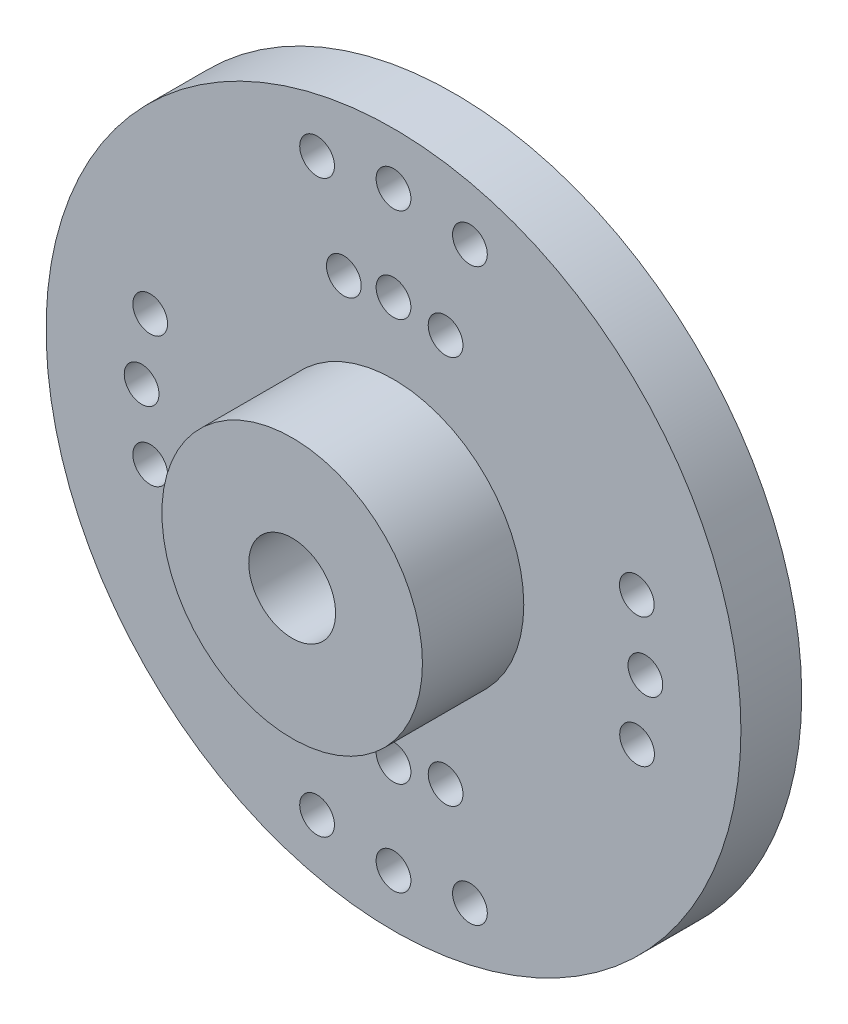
from build123d import *

# Parameters (mm, degrees)
ESQUISSE1_R             = 12
EXTRUSION1_DEPTH        = 2.1
ESQUISSE2_R             = 4.5
EXTRUSION2_DEPTH        = 3.5
ESQUISSE3_R             = 1.5
ESQUISSE3_R_2           = 0.6
ENL_V_MAT_EXTRU_1_DEPTH = 18.870646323


with BuildPart() as part:
    # Esquisse1 → Extrusion1 (new body)
    with BuildSketch(Plane.XY):
        Circle(ESQUISSE1_R)
    extrude(amount=EXTRUSION1_DEPTH)

    # Esquisse2 → Extrusion2 (add)
    with BuildSketch(Plane.XY.offset(2.1)):
        Circle(ESQUISSE2_R)
    extrude(amount=EXTRUSION2_DEPTH)

    # Esquisse3 → Enl_v. mat.-Extru.1 (cut, through all)
    with BuildSketch(Plane(origin=(0, 0, 0), x_dir=(-1, 0, 0), z_dir=(0, 0, -1))):
        Circle(ESQUISSE3_R)
        with Locations((-2.639937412, 9.852447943)):
            Circle(ESQUISSE3_R_2)
        with Locations((0, 10.2)):
            Circle(ESQUISSE3_R_2)
        with Locations((2.639551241, 9.852551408)):
            Circle(ESQUISSE3_R_2)
        with Locations((-2.640357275, -9.852335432)):
            Circle(ESQUISSE3_R_2)
        with Locations((0, -10.2)):
            Circle(ESQUISSE3_R_2)
        with Locations((2.639971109, -9.852438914)):
            Circle(ESQUISSE3_R_2)
        with Locations((-1.798775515, 6.713189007)):
            Circle(ESQUISSE3_R_2)
        with Locations((0, 6.95)):
            Circle(ESQUISSE3_R_2)
        with Locations((1.715228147, 6.735019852)):
            Circle(ESQUISSE3_R_2)
        with Locations((-1.799195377, -6.713076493)):
            Circle(ESQUISSE3_R_2)
        with Locations((1.798809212, -6.713179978)):
            Circle(ESQUISSE3_R_2)
        with Locations((0, -6.95)):
            Circle(ESQUISSE3_R_2)
        with Locations((-8.403497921, 2.251522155)):
            Circle(ESQUISSE3_R_2)
        with Locations((-8.699892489, 0)):
            Circle(ESQUISSE3_R_2)
        with Locations((-8.412398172, -2.218036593)):
            Circle(ESQUISSE3_R_2)
        with Locations((8.403262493, 2.252400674)):
            Circle(ESQUISSE3_R_2)
        with Locations((8.699892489, 0)):
            Circle(ESQUISSE3_R_2)
        with Locations((8.403403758, -2.251873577)):
            Circle(ESQUISSE3_R_2)
    extrude(amount=-ENL_V_MAT_EXTRU_1_DEPTH, mode=Mode.SUBTRACT)


solid = part.part
